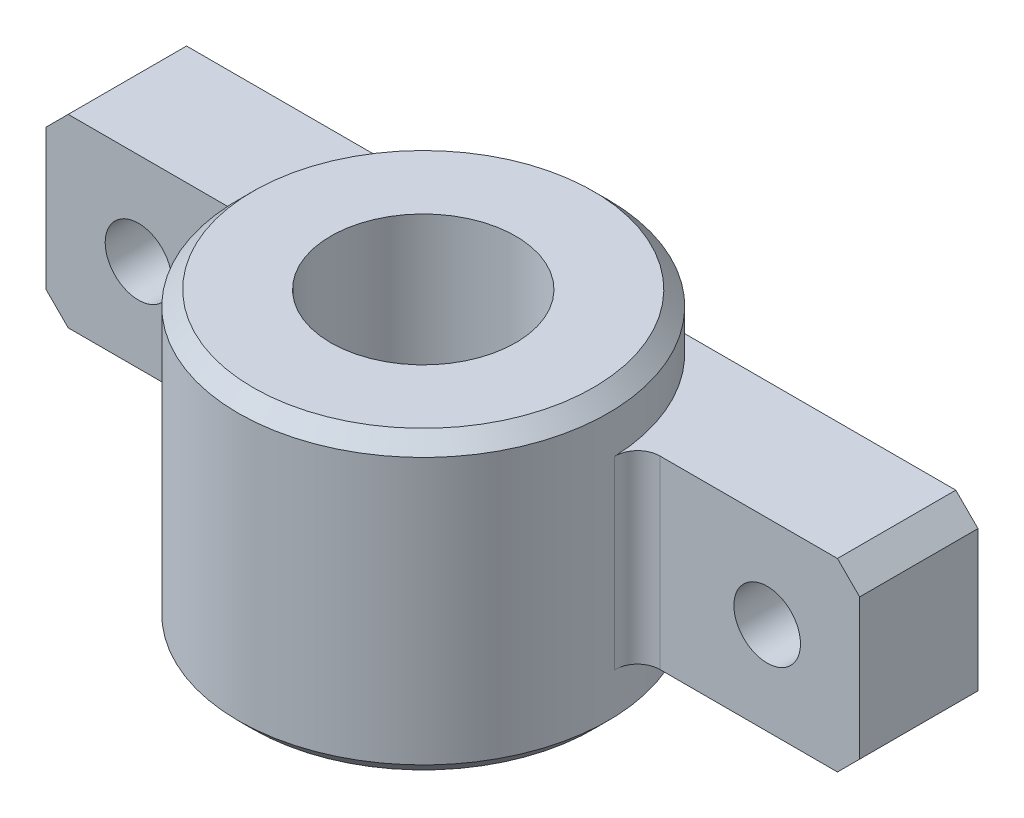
from build123d import *

# Parameters (mm, degrees)
SKETCH10_R               = 25
SKETCH10_R_2             = 12.5
BOSS_EXTRUDE2_DEPTH      = 20
SKETCH12_W               = 40
SKETCH12_H               = 16
BOSS_EXTRUDE4_DEPTH      = 12.5
CHAMFER1_SIZE            = 3
FILLET3_R                = 3
CHAMFER1_OF_MIRROR1_SIZE = 3
FILLET3_OF_MIRROR1_R     = 3
CHAMFER2_SIZE            = 2
CHAMFER3_SIZE            = 1


with BuildPart() as part:
    # Sketch10 → Boss-Extrude2 (new, symmetric)
    with BuildSketch(Plane(origin=(0, 0, 0), x_dir=(1, 0, 0), z_dir=(0, 1, 0))):
        with Locations(Location((0, 0, 0), (0, 0, 270))):
            Circle(SKETCH10_R)
        with Locations(Location((0, 0, 0), (0, 0, 270))):
            Circle(SKETCH10_R_2, mode=Mode.SUBTRACT)
    extrude(amount=BOSS_EXTRUDE2_DEPTH, both=True)

    # Sketch12 → Boss-Extrude4 (add, symmetric)
    with BuildSketch(Plane(origin=(0, 0, 0), x_dir=(1, 0, 0), z_dir=(0, 1, 0))):
        with Locations((-35, 12)):
            Rectangle(SKETCH12_W, SKETCH12_H)
    boss_extrude4 = extrude(amount=BOSS_EXTRUDE4_DEPTH, both=True)

    # Chamfer1
    chamfer1_edges = [part.edges().sort_by_distance(p)[0] for p in [
        (-55, -12.5, -12),
        (-55, 12.5, -12),
    ]]
    chamfer(chamfer1_edges, length=CHAMFER1_SIZE)

    # Fillet3
    fillet3_edges = [part.edges().sort_by_distance(p)[0] for p in [
        (-24.677925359, 0, -4),
    ]]
    fillet(fillet3_edges, radius=FILLET3_R)

    # Sketch14 → CBORE for M8 Hex Socket Head Cap Screw1 (revolve, cut)
    with BuildSketch(Plane(origin=(-42.5, 0, -20), x_dir=(0, 1, 0), z_dir=(1, 0, 0))):
        Polygon((0, 0), (0, 45), (4.5, 45), (4.5, 8.6), (7.5, 8.6), (7.5, 1.025), (8.525, 0), align=None)
    cbore_for_m8_hex_socket_head_cap_screw1 = revolve(axis=Axis((-42.5, 0, -26.35), (0, 0, 1)), mode=Mode.SUBTRACT)

    # Mirror1: Boss-Extrude4, CBORE for M8 Hex Socket Head Cap Screw1 across plane
    add(boss_extrude4.mirror(Plane(origin=(0, 0, 0), x_dir=(0, 0, 1), z_dir=(1, 0, 0))))
    add(cbore_for_m8_hex_socket_head_cap_screw1.mirror(Plane(origin=(0, 0, 0), x_dir=(0, 0, 1), z_dir=(1, 0, 0))), mode=Mode.SUBTRACT)

    # Chamfer1 of Mirror1
    chamfer1_of_mirror1_edges = [part.edges().sort_by_distance(p)[0] for p in [
        (55, -12.5, -12),
        (55, 12.5, -12),
    ]]
    chamfer(chamfer1_of_mirror1_edges, length=CHAMFER1_OF_MIRROR1_SIZE)

    # Fillet3 of Mirror1
    fillet3_of_mirror1_edges = [part.edges().sort_by_distance(p)[0] for p in [
        (24.677925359, 0, -4),
    ]]
    fillet(fillet3_of_mirror1_edges, radius=FILLET3_OF_MIRROR1_R)

    # Chamfer2
    chamfer2_edges = [part.edges().sort_by_distance(p)[0] for p in [
        (0, -20, -25),
        (0, 20, -25),
    ]]
    chamfer(chamfer2_edges, length=CHAMFER2_SIZE)

    # Chamfer3
    chamfer3_edges = [part.edges().sort_by_distance(p)[0] for p in [
        (0, -20, -12.5),
    ]]
    chamfer(chamfer3_edges, length=CHAMFER3_SIZE)


solid = part.part
